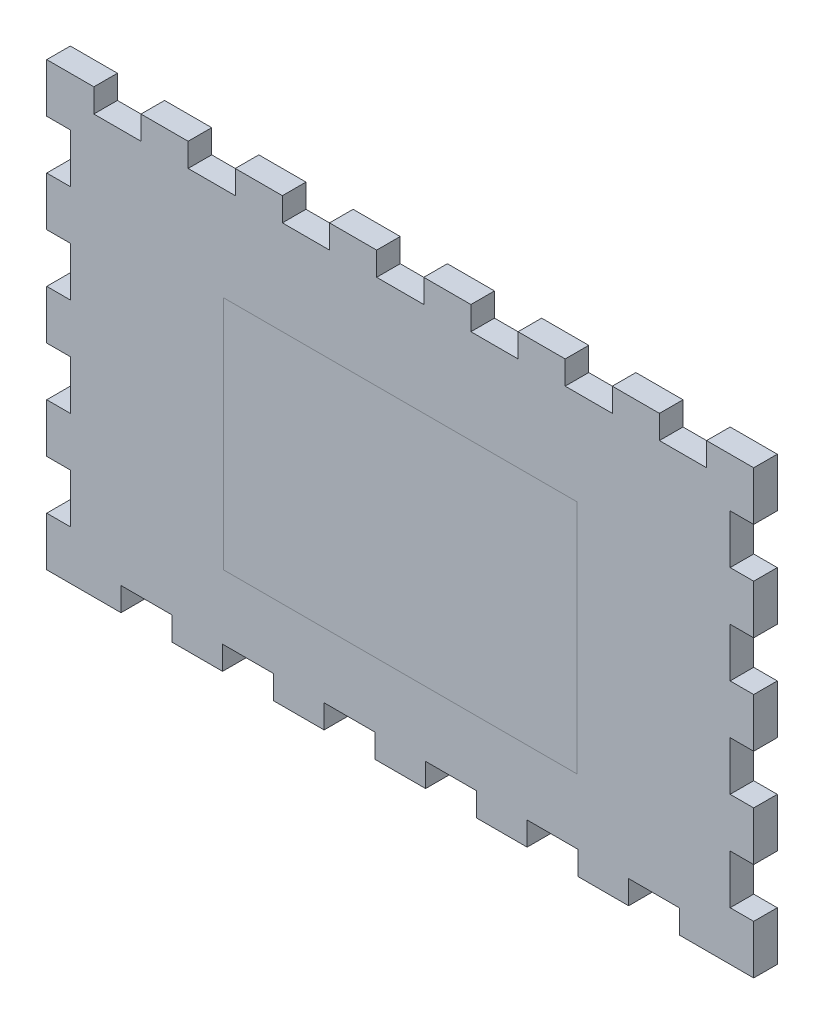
from build123d import *

# Parameters (mm, degrees)
BOSS_EXTRUDE1_DEPTH = 4


with BuildPart() as part:
    # Model → Boss-Extrude1 (new body)
    with BuildSketch(Plane.XY):
        Polygon((79, 0), (83, 0), (91.61, 0), (91.61, 4), (100.23, 4), (100.23, 0), (108.85, 0), (108.85, 4), (117.46, 4), (117.46, 0), (126.08, 0), (126.08, 4), (134.69, 4), (134.69, 0), (143.31, 0), (143.31, 4), (151.92, 4), (151.92, 0), (160.54, 0), (160.54, 4), (169.15, 4), (169.15, 0), (177.77, 0), (177.77, 4), (186.38, 4), (186.38, 0), (195, 0), (199, 0), (199, 8.33), (195, 8.33), (195, 16.67), (199, 16.67), (199, 25), (195, 25), (195, 33.33), (199, 33.33), (199, 41.67), (195, 41.67), (195, 50), (199, 50), (199, 58.33), (195, 58.33), (195, 66.67), (199, 66.67), (199, 75), (191, 75), (191, 71), (183, 71), (183, 75), (175, 75), (175, 71), (167, 71), (167, 75), (159, 75), (159, 71), (151, 71), (151, 75), (143, 75), (143, 71), (135, 71), (135, 75), (127, 75), (127, 71), (119, 71), (119, 75), (111, 75), (111, 71), (103, 71), (103, 75), (95, 75), (95, 71), (87, 71), (87, 75), (79, 75), (79, 66.67), (83, 66.67), (83, 58.33), (79, 58.33), (79, 50), (83, 50), (83, 41.67), (79, 41.67), (79, 33.33), (83, 33.33), (83, 25), (79, 25), (79, 16.67), (83, 16.67), (83, 8.33), (79, 8.33), align=None)
    extrude(amount=BOSS_EXTRUDE1_DEPTH)


solid = part.part
